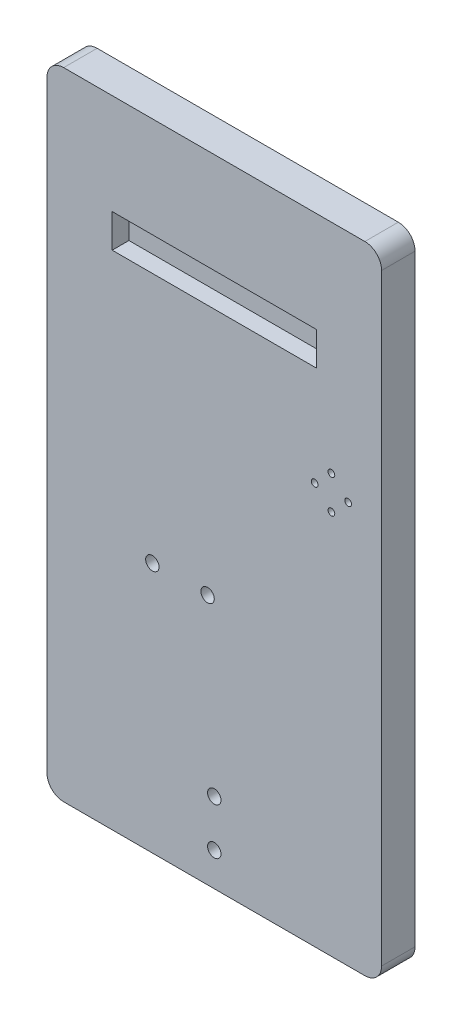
from build123d import *

# Parameters (mm, degrees)
ESQUISSE1_W              = 100
ESQUISSE1_H              = 190
EXTRUSION1_DEPTH         = 10
CONG_1_R                 = 5
ESQUISSE13_W             = 61
ESQUISSE13_H             = 10
ENL_V_MAT_EXTRU_8_DEPTH  = 5
ESQUISSE14_R             = 2
ENL_V_MAT_EXTRU_9_DEPTH  = 10
ESQUISSE15_R             = 1.005
ENL_V_MAT_EXTRU_10_DEPTH = 10
ESQUISSE16_R             = 2
ENL_V_MAT_EXTRU_11_DEPTH = 10


with BuildPart() as part:
    # Esquisse1 → Extrusion1 (new body)
    with BuildSketch(Plane.XY):
        with Locations((-50, 95)):
            Rectangle(ESQUISSE1_W, ESQUISSE1_H)
    extrude(amount=EXTRUSION1_DEPTH)

    # Cong_1
    cong_1_edges = [part.edges().sort_by_distance(p)[0] for p in [
        (-100, 190, 5),
        (0, 190, 5),
        (0, 0, 5),
        (-100, 0, 5),
    ]]
    fillet(cong_1_edges, radius=CONG_1_R)

    # Esquisse13 → Enl_v. mat.-Extru.8 (cut)
    with BuildSketch(Plane.XY.offset(10)):
        with Locations((-50, 155)):
            Rectangle(ESQUISSE13_W, ESQUISSE13_H)
    extrude(amount=-ENL_V_MAT_EXTRU_8_DEPTH, mode=Mode.SUBTRACT)

    # Esquisse14 → Enl_v. mat.-Extru.9 (cut)
    with BuildSketch(Plane.XY.offset(10)):
        with Locations((-68.5, 75)):
            Circle(ESQUISSE14_R)
        with Locations((-52, 75)):
            Circle(ESQUISSE14_R)
    extrude(amount=-ENL_V_MAT_EXTRU_9_DEPTH, mode=Mode.SUBTRACT)

    # Esquisse15 → Enl_v. mat.-Extru.10 (cut)
    with BuildSketch(Plane.XY.offset(10)):
        with Locations((-10, 120)):
            Circle(ESQUISSE15_R)
        with Locations((-20, 120)):
            Circle(ESQUISSE15_R)
        with Locations((-15, 125)):
            Circle(ESQUISSE15_R)
        with Locations((-15, 115)):
            Circle(ESQUISSE15_R)
    extrude(amount=-ENL_V_MAT_EXTRU_10_DEPTH, mode=Mode.SUBTRACT)

    # Esquisse16 → Enl_v. mat.-Extru.11 (cut)
    with BuildSketch(Plane.XY.offset(10)):
        with Locations((-50, 10)):
            Circle(ESQUISSE16_R)
        with Locations((-50, 23.9)):
            Circle(ESQUISSE16_R)
    extrude(amount=-ENL_V_MAT_EXTRU_11_DEPTH, mode=Mode.SUBTRACT)


solid = part.part
